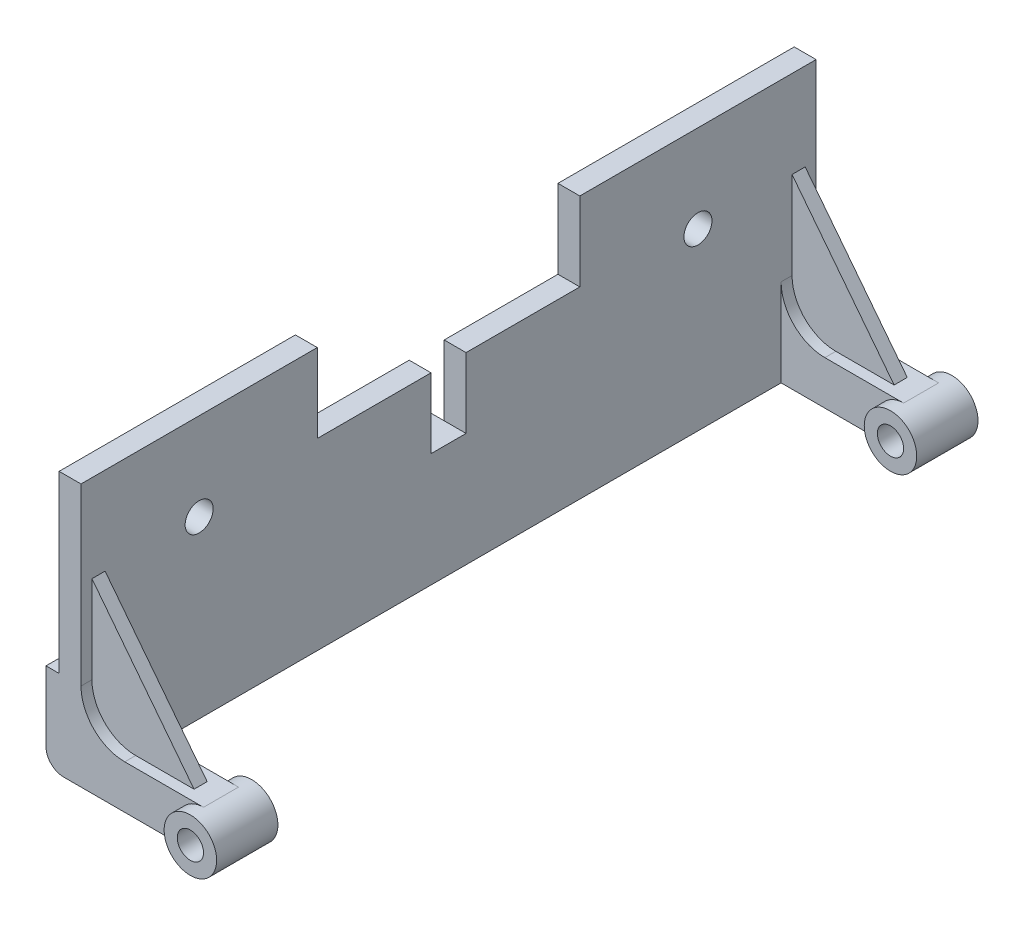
from build123d import *
from build123d.topology import SkipClean

# Parameters (mm, degrees)
ESQUISSE1_W             = 4
ESQUISSE1_H             = 30
EXTRUSION1_DEPTH        = 42
EXTRUSION2_DEPTH        = 4
ESQUISSE3_R             = 3
EXTRUSION3_DEPTH        = 1.5
CONG_1_R                = 5
NERVURE1_REACH          = 54.038
ESQUISSE6_WALL_W        = 128.880403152
ESQUISSE6_WALL_H        = 1.5
ESQUISSE7_W             = 1.5
ESQUISSE7_H             = 20
ENL_V_MAT_EXTRU_3_DEPTH = 54.591044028
EXTRUSION5_START        = 1.5
ESQUISSE11_R            = 3
EXTRUSION5_DEPTH        = 1.5
ESQUISSE12_R            = 1.5
ENL_V_MAT_EXTRU_6_DEPTH = 55.77453788
ESQUISSE15_R            = 1.6
ENL_V_MAT_EXTRU_8_DEPTH = 56.285622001
CONG_3_R                = 2
ESQUISSE9_W             = 30
ESQUISSE9_H             = 9
ENL_V_MAT_EXTRU_5_DEPTH = 56.285622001
ESQUISSE13_W            = 4
ESQUISSE13_H            = 8
ENL_V_MAT_EXTRU_7_DEPTH = 55.45410912
ESQUISSE14_W            = 4
ESQUISSE14_H            = 3
EXTRUSION6_DEPTH        = 1.5


with BuildPart() as part:
    # Esquisse1 → Extrusion1 (new body)
    with BuildSketch(Plane.XY):
        with Locations((-16, 13)):
            Rectangle(ESQUISSE1_W, ESQUISSE1_H)
    extrude(amount=EXTRUSION1_DEPTH)

    # Esquisse2 → Extrusion2 (add)
    with BuildSketch(Plane.XY.offset(42)):
        with BuildLine():
            Line((-14, 3), (-14, -2))
            Line((-14, -2), (-2.236067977, -2))
            ThreePointArc((-2.236067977, -2), (2.738612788, -1.224744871), (0, 3))
            Line((0, 3), (-14, 3))
        make_face()
    extrude(amount=-EXTRUSION2_DEPTH)

    # Esquisse3 → Extrusion3 (add)
    with SkipClean():  # the faces are left unmerged after this step: merging them gives an invalid solid
        with BuildSketch(Plane(origin=(0, 0, 38), x_dir=(-1, 0, 0), z_dir=(0, 0, -1))):
            with Locations(Location((0, 0, 0), (0, 0, 90))):
                Circle(ESQUISSE3_R)
        extrude(amount=EXTRUSION3_DEPTH)

    # Cong_1
    cong_1_edges = [part.edges().sort_by_distance(p)[0] for p in [
        (-14, 3, 40),
    ]]
    fillet(cong_1_edges, radius=CONG_1_R)

    # Esquisse6 wall → Nervure1 (add, up to next)
    with BuildSketch(Plane(origin=(-7, 9, 40), x_dir=(0.613940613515, -0.789352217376, 0), z_dir=(0.789352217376, 0.613940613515, 0)), mode=Mode.PRIVATE) as nervure1_sk1:
        Rectangle(ESQUISSE6_WALL_W, ESQUISSE6_WALL_H)
    nervure1_tool1 = extrude(nervure1_sk1.sketch, amount=-NERVURE1_REACH, mode=Mode.PRIVATE) - part.part
    add(nervure1_tool1.solids().sort_by_distance((-7, 9, 40))[0])

    # Esquisse7 → Enl_v. mat.-Extru.3 (cut, through all)
    with SkipClean():  # the faces are left unmerged after this step: merging them gives an invalid solid
        with BuildSketch(Plane.XY):
            with Locations((-17.25, 18)):
                Rectangle(ESQUISSE7_W, ESQUISSE7_H)
        extrude(amount=ENL_V_MAT_EXTRU_3_DEPTH, mode=Mode.SUBTRACT)

    # Esquisse11 → Extrusion5 (add)
    with BuildSketch(Plane.XY.offset(42).offset(EXTRUSION5_START)):
        Circle(ESQUISSE11_R)
    extrude(amount=-EXTRUSION5_DEPTH)

    # Esquisse12 → Enl_v. mat.-Extru.6 (cut, through all)
    with BuildSketch(Plane.XY.offset(43.5)):
        Circle(ESQUISSE12_R)
    extrude(amount=-ENL_V_MAT_EXTRU_6_DEPTH, mode=Mode.SUBTRACT)

    # Esquisse15 → Enl_v. mat.-Extru.8 (cut, through all)
    with BuildSketch(Plane.ZY.offset(16.5)):
        with Locations(Location((28.5, 18, 0), (0, 0, 270))):
            Circle(ESQUISSE15_R)
    extrude(amount=-ENL_V_MAT_EXTRU_8_DEPTH, mode=Mode.SUBTRACT)

    # Sym_trie1: part across plane


with BuildPart() as part_1:
    add(part.part)
    add(part.part.mirror(Plane(origin=(-18, 28, 0), x_dir=(1, 0, 0), z_dir=(0, 0, -1))))

    # Cong_3
    cong_3_edges = [part_1.edges().sort_by_distance(p)[0] for p in [
        (-18, -2, 0),
    ]]
    fillet(cong_3_edges, radius=CONG_3_R)

    # Esquisse9 → Enl_v. mat.-Extru.5 (cut, through all)
    with BuildSketch(Plane.ZY.offset(16.5)):
        with Locations((0, 23.5)):
            Rectangle(ESQUISSE9_W, ESQUISSE9_H)
    extrude(amount=-ENL_V_MAT_EXTRU_5_DEPTH, mode=Mode.SUBTRACT)

    # Esquisse13 → Enl_v. mat.-Extru.7 (cut, through all)
    with BuildSketch(Plane(origin=(-14, 0, 0), x_dir=(0, 0, -1), z_dir=(1, 0, 0))):
        with Locations((0, 15)):
            Rectangle(ESQUISSE13_W, ESQUISSE13_H)
    extrude(amount=-ENL_V_MAT_EXTRU_7_DEPTH, mode=Mode.SUBTRACT)

    # Esquisse14 → Extrusion6 (add)
    with BuildSketch(Plane.ZY.offset(16.5)):
        with Locations((0, 9.5)):
            Rectangle(ESQUISSE14_W, ESQUISSE14_H)
    extrude(amount=EXTRUSION6_DEPTH)


solid = part_1.part
